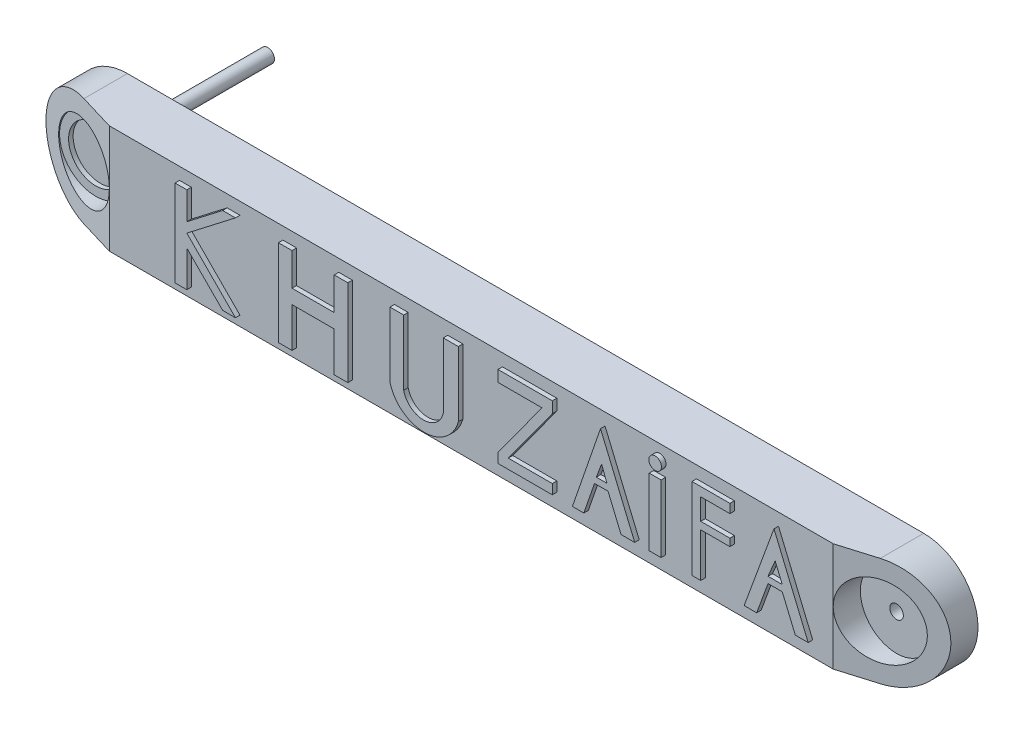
from build123d import *

# Parameters (mm, degrees)
BOSS_EXTRUDE1_DEPTH      = 60
BOSS_EXTRUDE1_DEPTH_BACK = 60
SKETCH1_W                = 2000
SKETCH1_H                = 240
CUT_EXTRUDE1_DEPTH       = 125
CUT_EXTRUDE1_DEPTH_BACK  = 203
SKETCH3_R                = 80
CUT_EXTRUDE2_DEPTH       = 332
CUT_EXTRUDE3_DEPTH       = 274
CUT_EXTRUDE3_DEPTH_BACK  = 321
SKETCH5_R                = 80
SKETCH5_R_2              = 60
BOSS_EXTRUDE2_DEPTH      = 10
SKETCH6_R                = 15
BOSS_EXTRUDE3_DEPTH      = 530
SKETCH7_R                = 15
CUT_EXTRUDE4_DEPTH       = 530
CUT_EXTRUDE5_DEPTH       = 66
CUT_EXTRUDE5_DEPTH_BACK  = 193
SKETCH9_W                = 283.673506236
SKETCH9_H                = 374.258323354
SKETCH10_W               = 19.479624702
SKETCH10_H               = 179.936685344
SKETCH10_W_2             = 64.432604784
SKETCH10_H_2             = 16.293098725
SKETCH10_H_3             = 19.670788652
SKETCH10_W_3             = 26.222571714
SKETCH10_H_4             = 148.73380458
SKETCH10_R               = 13.941263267
SKETCH10_W_4             = 120.113521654
SKETCH10_H_5             = 21.593442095
SKETCH10_H_6             = 24.733820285
SKETCH10_W_5             = 30.413650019
SKETCH10_H_7             = 144.017686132
SKETCH10_W_6             = 33.178527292
SKETCH10_W_7             = 30
SKETCH10_H_8             = 191.192516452
SKETCH10_W_8             = 93.313516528
SKETCH10_H_9             = 31.335275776
SKETCH10_W_9             = 26.020283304
BOSS_EXTRUDE6_DEPTH      = 70


with BuildPart() as part:
    # Sketch1 → Boss-Extrude1 (new, two sides: drawn at the far end of the back side and taken through both)
    with BuildSketch(Plane.XY.offset(-BOSS_EXTRUDE1_DEPTH_BACK)):
        Rectangle(SKETCH1_W, SKETCH1_H)
    extrude(amount=BOSS_EXTRUDE1_DEPTH + BOSS_EXTRUDE1_DEPTH_BACK)

    # Sketch2 → Cut-Extrude1 (cut, two sides: drawn at the far end of the back side and taken through both)
    with BuildSketch(Plane.XY.offset(-CUT_EXTRUDE1_DEPTH_BACK)):
        with BuildLine():
            Line((-880, 120), (-1006.825608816, 281.646305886))
            Line((-1006.825608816, 281.646305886), (-1134.79266536, 120))
            Line((-1134.79266536, 120), (-1063.819339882, -191.509197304))
            Line((-1063.819339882, -191.509197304), (-862.728251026, -191.509197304))
            Line((-862.728251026, -191.509197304), (-880, -120))
            ThreePointArc((-880, -120), (-1000, 0), (-880, 120))
        make_face()
        with BuildLine():
            Line((880, 120), (893.27601501, 184.167147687))
            Line((893.27601501, 184.167147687), (1104.453001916, 184.167147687))
            Line((1104.453001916, 184.167147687), (1104.453001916, -100.878332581))
            Line((1104.453001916, -100.878332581), (1008.858481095, -155.754598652))
            Line((1008.858481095, -155.754598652), (880, -120))
            ThreePointArc((880, -120), (1000, 0), (880, 120))
        make_face()
    extrude(amount=CUT_EXTRUDE1_DEPTH + CUT_EXTRUDE1_DEPTH_BACK, mode=Mode.SUBTRACT)

    # Sketch3 → Cut-Extrude2 (cut)
    with BuildSketch(Plane.XY):
        with Locations(Location((-880, 0, 0), (0, 0, 180))):
            Circle(SKETCH3_R)
        with Locations(Location((880, 0, 0), (0, 0, 180))):
            Circle(SKETCH3_R)
    extrude(amount=CUT_EXTRUDE2_DEPTH, mode=Mode.SUBTRACT)

    # Sketch4 → Cut-Extrude3 (cut, two sides: drawn at the far end of the back side and taken through both)
    with BuildSketch(Plane(origin=(0, 0, 0), x_dir=(1, 0, 0), z_dir=(0, 1, 0)).offset(-CUT_EXTRUDE3_DEPTH_BACK)):
        Polygon((-800, -60), (-1000, 0), (-1030.608079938, -49.976511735), (-1007.288101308, -94.135620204), (-816.758914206, -82.723715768), align=None)
        Polygon((800, -60), (1000, 0), (1023.971167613, -45.392211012), (975.065808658, -111.70387433), (805.564412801, -78.548042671), align=None)
    extrude(amount=CUT_EXTRUDE3_DEPTH + CUT_EXTRUDE3_DEPTH_BACK, mode=Mode.SUBTRACT)

    # Sketch5 → Boss-Extrude2 (add)
    with BuildSketch(Plane.XY):
        with Locations((-880, 0)):
            Circle(SKETCH5_R)
        with Locations((-880, 0)):
            Circle(SKETCH5_R_2, mode=Mode.SUBTRACT)
    extrude(amount=BOSS_EXTRUDE2_DEPTH)

    # Sketch6 → Boss-Extrude3 (add)
    with BuildSketch(Plane.XY):
        with Locations((-880, 0)):
            Circle(SKETCH6_R)
    extrude(amount=-BOSS_EXTRUDE3_DEPTH)

    # Sketch7 → Cut-Extrude4 (cut)
    with BuildSketch(Plane.XY):
        with Locations((880, 0)):
            Circle(SKETCH7_R)
    extrude(amount=-CUT_EXTRUDE4_DEPTH, mode=Mode.SUBTRACT)

    # Sketch9 → Cut-Extrude5 (cut, two sides: drawn at the far end of the back side and taken through both)
    with BuildSketch(Plane(origin=(0, 0, 0), x_dir=(1, 0, 0), z_dir=(0, 1, 0)).offset(-CUT_EXTRUDE5_DEPTH_BACK)):
        with Locations((-879.626250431, 557.129161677)):
            Rectangle(SKETCH9_W, SKETCH9_H)
    extrude(amount=CUT_EXTRUDE5_DEPTH + CUT_EXTRUDE5_DEPTH_BACK, mode=Mode.SUBTRACT)

    # Sketch10 → Boss-Extrude6 (add)
    # profile 1 of 19: a face of its own
    with BuildSketch(Plane.XY):
        Polygon((640.788844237, -86.805767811), (613.107018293, -86.805767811), (679.038055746, 93.130917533), (754.708905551, -86.805767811), (726.238684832, -86.805767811), (697.418231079, -18.274002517), (665.899734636, -18.274002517), align=None)
        Polygon((681.658982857, 33.116651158), (665.899734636, -4.357051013), (697.418231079, -4.357051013), align=None, mode=Mode.SUBTRACT)
    # profile 2 of 19: a face of its own
    with BuildSketch(Plane.XY):
        with Locations((507.467515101, 3.162574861)):
            Rectangle(SKETCH10_W, SKETCH10_H)
    # profile 3 of 19: a face of its own
    with BuildSketch(Plane.XY):
        with Locations((549.423629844, 18.368116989)):
            Rectangle(SKETCH10_W_2, SKETCH10_H_2)
    # profile 4 of 19: a face of its own
    with BuildSketch(Plane.XY):
        with Locations((549.423629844, 83.295523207)):
            Rectangle(SKETCH10_W_2, SKETCH10_H_3)
    # profile 5 of 19: a face of its own
    with BuildSketch(Plane.XY):
        with Locations((416.437730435, -12.438865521)):
            Rectangle(SKETCH10_W_3, SKETCH10_H_4)
    # profile 6 of 19: a face of its own
    with BuildSketch(Plane.XY):
        with Locations(Location((416.437730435, 87.401392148, 0), (0, 0, 180))):
            Circle(SKETCH10_R)
    # profile 7 of 19: a face of its own
    with BuildSketch(Plane.XY):
        Polygon((258.769551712, -86.805767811), (233.581491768, -86.805767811), (295.662637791, 93.130917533), (371.239685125, -86.805767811), (341.090764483, -86.805767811), (312.306036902, -18.274002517), (282.414149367, -18.274002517), align=None)
        Polygon((298.099793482, 26.514666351), (286.417032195, -4.357051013), (309.782554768, -4.357051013), align=None, mode=Mode.SUBTRACT)
    # profile 8 of 19: a face of its own
    with BuildSketch(Plane.XY):
        with Locations((128.988256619, -76.009046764)):
            Rectangle(SKETCH10_W_4, SKETCH10_H_5)
    # profile 9 of 19: a face of its own
    with BuildSketch(Plane.XY):
        Polygon((91.695250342, -65.212325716), (189.045017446, 68.397097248), (166.573052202, 68.397097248), (68.931495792, -65.212325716), align=None)
    # profile 10 of 19: a face of its own
    with BuildSketch(Plane.XY):
        with Locations((128.988256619, 80.764007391)):
            Rectangle(SKETCH10_W_4, SKETCH10_H_6)
    # profile 11 of 19: a face of its own
    with BuildSketch(Plane.XY):
        with Locations((-154.604898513, 21.122074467)):
            Rectangle(SKETCH10_W_5, SKETCH10_H_7)
    # profile 12 of 19: a face of its own
    with BuildSketch(Plane.XY):
        with BuildLine():
            Line((-169.811723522, -50.886768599), (-139.398073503, -50.886768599))
            ThreePointArc((-139.398073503, -50.886768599), (-95.620849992, -85.912634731), (-51.843626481, -50.886768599))
            Line((-51.843626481, -50.886768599), (-18.665099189, -50.886768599))
            ThreePointArc((-18.665099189, -50.886768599), (-94.238411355, -108.801645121), (-169.811723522, -50.886768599))
        make_face()
    # profile 13 of 19: a face of its own
    with BuildSketch(Plane.XY):
        with Locations((-35.254362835, 21.122074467)):
            Rectangle(SKETCH10_W_6, SKETCH10_H_7)
    # profile 14 of 19: a face of its own
    with BuildSketch(Plane.XY):
        with Locations((-277.866698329, -2.465340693)):
            Rectangle(SKETCH10_W_7, SKETCH10_H_8)
    # profile 15 of 19: a face of its own
    with BuildSketch(Plane.XY):
        with Locations((-339.523456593, 5.332402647)):
            Rectangle(SKETCH10_W_8, SKETCH10_H_9)
    # profile 16 of 19: a face of its own
    with BuildSketch(Plane.XY):
        with Locations((-401.180214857, -2.465340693)):
            Rectangle(SKETCH10_W_7, SKETCH10_H_8)
    # profile 17 of 19: a face of its own
    with BuildSketch(Plane.XY):
        with Locations((-631.696039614, -2.465340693)):
            Rectangle(SKETCH10_W_9, SKETCH10_H_8)
    # profile 18 of 19: a face of its own
    with BuildSketch(Plane.XY):
        Polygon((-539.493731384, 93.130917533), (-618.685897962, 32.039817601), (-618.685897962, 10.221567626), (-511.21081475, 93.130917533), align=None)
    # profile 19 of 19: a face of its own
    with BuildSketch(Plane.XY):
        Polygon((-511.21081475, -98.061598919), (-618.685897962, 10.221567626), (-618.685897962, -18.274002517), (-539.493731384, -98.061598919), align=None)
    extrude(amount=BOSS_EXTRUDE6_DEPTH)


solid = part.part
